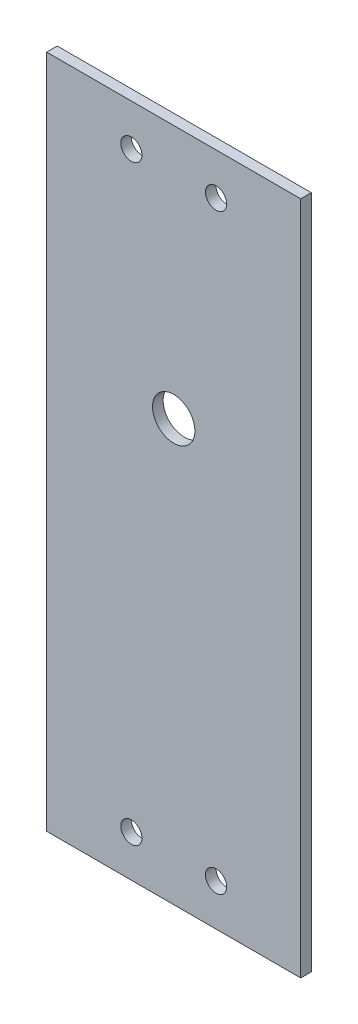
ISO-10303-21;
HEADER;
FILE_DESCRIPTION(('STEP AP214'),'2;1');
FILE_NAME('part.step','',(''),(''),'','','');
FILE_SCHEMA(('AUTOMOTIVE_DESIGN { 1 0 10303 214 1 1 1 1 }'));
ENDSEC;
DATA;
#1=APPLICATION_CONTEXT('core data for automotive mechanical design processes');
#2=APPLICATION_PROTOCOL_DEFINITION('international standard','automotive_design',2000,#1);
#3=PRODUCT_CONTEXT('',#1,'mechanical');
#4=PRODUCT('Part','Part','',(#3));
#5=PRODUCT_RELATED_PRODUCT_CATEGORY('part','',(#4));
#6=PRODUCT_DEFINITION_FORMATION('','',#4);
#7=PRODUCT_DEFINITION_CONTEXT('part definition',#1,'design');
#8=PRODUCT_DEFINITION('design','',#6,#7);
#9=PRODUCT_DEFINITION_SHAPE('','',#8);
#10=(LENGTH_UNIT() NAMED_UNIT(*) SI_UNIT(.MILLI.,.METRE.));
#11=(NAMED_UNIT(*) PLANE_ANGLE_UNIT() SI_UNIT($,.RADIAN.));
#12=(NAMED_UNIT(*) SI_UNIT($,.STERADIAN.) SOLID_ANGLE_UNIT());
#13=UNCERTAINTY_MEASURE_WITH_UNIT(LENGTH_MEASURE(1.E-05),#10,'distance_accuracy_value','');
#14=(GEOMETRIC_REPRESENTATION_CONTEXT(3) GLOBAL_UNCERTAINTY_ASSIGNED_CONTEXT((#13)) GLOBAL_UNIT_ASSIGNED_CONTEXT((#10,
#11,#12)) REPRESENTATION_CONTEXT('',''));
#15=CARTESIAN_POINT('',(0.,0.,0.));
#16=DIRECTION('',(0.,0.,1.));
#17=DIRECTION('',(1.,0.,0.));
#18=AXIS2_PLACEMENT_3D('',#15,#16,#17);
#19=CARTESIAN_POINT('',(76.2,0.,3.175));
#20=DIRECTION('',(0.,-1.,0.));
#21=DIRECTION('',(1.,0.,0.));
#22=AXIS2_PLACEMENT_3D('',#19,#20,#21);
#23=PLANE('',#22);
#24=DIRECTION('',(-1.,0.,0.));
#25=VECTOR('',#24,1.);
#26=CARTESIAN_POINT('',(76.2,0.,0.));
#27=LINE('',#26,#25);
#28=CARTESIAN_POINT('',(76.2,0.,0.));
#29=VERTEX_POINT('',#28);
#30=CARTESIAN_POINT('',(0.,0.,0.));
#31=VERTEX_POINT('',#30);
#32=EDGE_CURVE('E117',#29,#31,#27,.T.);
#33=ORIENTED_EDGE('',*,*,#32,.T.);
#34=DIRECTION('',(0.,0.,-1.));
#35=VECTOR('',#34,1.);
#36=CARTESIAN_POINT('',(0.,0.,3.175));
#37=LINE('',#36,#35);
#38=CARTESIAN_POINT('',(0.,0.,3.175));
#39=VERTEX_POINT('',#38);
#40=EDGE_CURVE('E12',#39,#31,#37,.T.);
#41=ORIENTED_EDGE('',*,*,#40,.F.);
#42=DIRECTION('',(-1.,0.,0.));
#43=VECTOR('',#42,1.);
#44=CARTESIAN_POINT('',(76.2,0.,3.175));
#45=LINE('',#44,#43);
#46=CARTESIAN_POINT('',(76.2,0.,3.175));
#47=VERTEX_POINT('',#46);
#48=EDGE_CURVE('E101',#47,#39,#45,.T.);
#49=ORIENTED_EDGE('',*,*,#48,.F.);
#50=DIRECTION('',(0.,0.,-1.));
#51=VECTOR('',#50,1.);
#52=CARTESIAN_POINT('',(76.2,0.,3.175));
#53=LINE('',#52,#51);
#54=EDGE_CURVE('E111',#47,#29,#53,.T.);
#55=ORIENTED_EDGE('',*,*,#54,.T.);
#56=EDGE_LOOP('',(#33,#41,#49,#55));
#57=FACE_BOUND('',#56,.T.);
#58=ADVANCED_FACE('F50',(#57),#23,.F.);
#59=CARTESIAN_POINT('',(0.,0.,3.175));
#60=DIRECTION('',(1.,0.,0.));
#61=DIRECTION('',(0.,1.,0.));
#62=AXIS2_PLACEMENT_3D('',#59,#60,#61);
#63=PLANE('',#62);
#64=DIRECTION('',(0.,-1.,0.));
#65=VECTOR('',#64,1.);
#66=CARTESIAN_POINT('',(0.,0.,0.));
#67=LINE('',#66,#65);
#68=CARTESIAN_POINT('',(0.,-202.4,0.));
#69=VERTEX_POINT('',#68);
#70=EDGE_CURVE('E106',#31,#69,#67,.T.);
#71=ORIENTED_EDGE('',*,*,#70,.T.);
#72=DIRECTION('',(0.,0.,-1.));
#73=VECTOR('',#72,1.);
#74=CARTESIAN_POINT('',(0.,-202.4,3.175));
#75=LINE('',#74,#73);
#76=CARTESIAN_POINT('',(0.,-202.4,3.175));
#77=VERTEX_POINT('',#76);
#78=EDGE_CURVE('E58',#77,#69,#75,.T.);
#79=ORIENTED_EDGE('',*,*,#78,.F.);
#80=DIRECTION('',(0.,-1.,0.));
#81=VECTOR('',#80,1.);
#82=CARTESIAN_POINT('',(0.,0.,3.175));
#83=LINE('',#82,#81);
#84=EDGE_CURVE('E96',#39,#77,#83,.T.);
#85=ORIENTED_EDGE('',*,*,#84,.F.);
#86=ORIENTED_EDGE('',*,*,#40,.T.);
#87=EDGE_LOOP('',(#71,#79,#85,#86));
#88=FACE_BOUND('',#87,.T.);
#89=ADVANCED_FACE('F105',(#88),#63,.F.);
#90=CARTESIAN_POINT('',(0.,-202.4,3.175));
#91=DIRECTION('',(0.,1.,0.));
#92=DIRECTION('',(0.,0.,1.));
#93=AXIS2_PLACEMENT_3D('',#90,#91,#92);
#94=PLANE('',#93);
#95=DIRECTION('',(1.,0.,0.));
#96=VECTOR('',#95,1.);
#97=CARTESIAN_POINT('',(0.,-202.4,0.));
#98=LINE('',#97,#96);
#99=CARTESIAN_POINT('',(76.2,-202.4,0.));
#100=VERTEX_POINT('',#99);
#101=EDGE_CURVE('E83',#69,#100,#98,.T.);
#102=ORIENTED_EDGE('',*,*,#101,.T.);
#103=DIRECTION('',(0.,0.,-1.));
#104=VECTOR('',#103,1.);
#105=CARTESIAN_POINT('',(76.2,-202.4,3.175));
#106=LINE('',#105,#104);
#107=CARTESIAN_POINT('',(76.2,-202.4,3.175));
#108=VERTEX_POINT('',#107);
#109=EDGE_CURVE('E107',#108,#100,#106,.T.);
#110=ORIENTED_EDGE('',*,*,#109,.F.);
#111=DIRECTION('',(1.,0.,0.));
#112=VECTOR('',#111,1.);
#113=CARTESIAN_POINT('',(0.,-202.4,3.175));
#114=LINE('',#113,#112);
#115=EDGE_CURVE('E99',#77,#108,#114,.T.);
#116=ORIENTED_EDGE('',*,*,#115,.F.);
#117=ORIENTED_EDGE('',*,*,#78,.T.);
#118=EDGE_LOOP('',(#102,#110,#116,#117));
#119=FACE_BOUND('',#118,.T.);
#120=ADVANCED_FACE('F108',(#119),#94,.F.);
#121=CARTESIAN_POINT('',(76.2,-202.4,3.175));
#122=DIRECTION('',(-1.,0.,0.));
#123=DIRECTION('',(0.,0.,1.));
#124=AXIS2_PLACEMENT_3D('',#121,#122,#123);
#125=PLANE('',#124);
#126=DIRECTION('',(0.,1.,0.));
#127=VECTOR('',#126,1.);
#128=CARTESIAN_POINT('',(76.2,-202.4,0.));
#129=LINE('',#128,#127);
#130=EDGE_CURVE('E89',#100,#29,#129,.T.);
#131=ORIENTED_EDGE('',*,*,#130,.T.);
#132=ORIENTED_EDGE('',*,*,#54,.F.);
#133=DIRECTION('',(0.,1.,0.));
#134=VECTOR('',#133,1.);
#135=CARTESIAN_POINT('',(76.2,-202.4,3.175));
#136=LINE('',#135,#134);
#137=EDGE_CURVE('E66',#108,#47,#136,.T.);
#138=ORIENTED_EDGE('',*,*,#137,.F.);
#139=ORIENTED_EDGE('',*,*,#109,.T.);
#140=EDGE_LOOP('',(#131,#132,#138,#139));
#141=FACE_BOUND('',#140,.T.);
#142=ADVANCED_FACE('F256',(#141),#125,.F.);
#143=CARTESIAN_POINT('',(0.,0.,3.175));
#144=DIRECTION('',(0.,0.,1.));
#145=DIRECTION('',(1.,0.,0.));
#146=AXIS2_PLACEMENT_3D('',#143,#144,#145);
#147=PLANE('',#146);
#148=CARTESIAN_POINT('',(38.1,-76.2,3.175));
#149=DIRECTION('',(0.,0.,1.));
#150=DIRECTION('',(1.,0.,0.));
#151=AXIS2_PLACEMENT_3D('',#148,#149,#150);
#152=CIRCLE('',#151,6.35);
#153=CARTESIAN_POINT('',(44.45,-76.2,3.175));
#154=VERTEX_POINT('',#153);
#155=EDGE_CURVE('E207',#154,#154,#152,.T.);
#156=ORIENTED_EDGE('',*,*,#155,.F.);
#157=EDGE_LOOP('',(#156));
#158=FACE_BOUND('',#157,.T.);
#159=CARTESIAN_POINT('',(25.4,-189.9,3.175));
#160=DIRECTION('',(0.,0.,1.));
#161=DIRECTION('',(-1.,0.,0.));
#162=AXIS2_PLACEMENT_3D('',#159,#160,#161);
#163=CIRCLE('',#162,3.175);
#164=CARTESIAN_POINT('',(22.225,-189.9,3.175));
#165=VERTEX_POINT('',#164);
#166=EDGE_CURVE('E140',#165,#165,#163,.T.);
#167=ORIENTED_EDGE('',*,*,#166,.F.);
#168=EDGE_LOOP('',(#167));
#169=FACE_BOUND('',#168,.T.);
#170=CARTESIAN_POINT('',(50.8,-189.9,3.175));
#171=DIRECTION('',(0.,0.,1.));
#172=DIRECTION('',(-1.,0.,0.));
#173=AXIS2_PLACEMENT_3D('',#170,#171,#172);
#174=CIRCLE('',#173,3.175);
#175=CARTESIAN_POINT('',(47.625,-189.9,3.175));
#176=VERTEX_POINT('',#175);
#177=EDGE_CURVE('E160',#176,#176,#174,.T.);
#178=ORIENTED_EDGE('',*,*,#177,.F.);
#179=EDGE_LOOP('',(#178));
#180=FACE_BOUND('',#179,.T.);
#181=CARTESIAN_POINT('',(50.8,-12.5,3.175));
#182=DIRECTION('',(0.,0.,1.));
#183=DIRECTION('',(1.,0.,0.));
#184=AXIS2_PLACEMENT_3D('',#181,#182,#183);
#185=CIRCLE('',#184,3.175);
#186=CARTESIAN_POINT('',(53.975,-12.5,3.175));
#187=VERTEX_POINT('',#186);
#188=EDGE_CURVE('E206',#187,#187,#185,.T.);
#189=ORIENTED_EDGE('',*,*,#188,.F.);
#190=EDGE_LOOP('',(#189));
#191=FACE_BOUND('',#190,.T.);
#192=CARTESIAN_POINT('',(25.4,-12.5,3.175));
#193=DIRECTION('',(0.,0.,1.));
#194=DIRECTION('',(1.,0.,0.));
#195=AXIS2_PLACEMENT_3D('',#192,#193,#194);
#196=CIRCLE('',#195,3.175);
#197=CARTESIAN_POINT('',(28.575,-12.5,3.175));
#198=VERTEX_POINT('',#197);
#199=EDGE_CURVE('E202',#198,#198,#196,.T.);
#200=ORIENTED_EDGE('',*,*,#199,.F.);
#201=EDGE_LOOP('',(#200));
#202=FACE_BOUND('',#201,.T.);
#203=ORIENTED_EDGE('',*,*,#48,.T.);
#204=ORIENTED_EDGE('',*,*,#84,.T.);
#205=ORIENTED_EDGE('',*,*,#115,.T.);
#206=ORIENTED_EDGE('',*,*,#137,.T.);
#207=EDGE_LOOP('',(#203,#204,#205,#206));
#208=FACE_BOUND('',#207,.T.);
#209=ADVANCED_FACE('F97',(#158,#169,#180,#191,#202,#208),#147,.T.);
#210=CARTESIAN_POINT('',(0.,0.,0.));
#211=DIRECTION('',(0.,0.,1.));
#212=DIRECTION('',(1.,0.,0.));
#213=AXIS2_PLACEMENT_3D('',#210,#211,#212);
#214=PLANE('',#213);
#215=CARTESIAN_POINT('',(38.1,-76.2,0.));
#216=DIRECTION('',(0.,0.,1.));
#217=DIRECTION('',(1.,0.,0.));
#218=AXIS2_PLACEMENT_3D('',#215,#216,#217);
#219=CIRCLE('',#218,6.35);
#220=CARTESIAN_POINT('',(44.45,-76.2,0.));
#221=VERTEX_POINT('',#220);
#222=EDGE_CURVE('E149',#221,#221,#219,.F.);
#223=ORIENTED_EDGE('',*,*,#222,.F.);
#224=EDGE_LOOP('',(#223));
#225=FACE_BOUND('',#224,.T.);
#226=CARTESIAN_POINT('',(25.4,-189.9,0.));
#227=DIRECTION('',(0.,0.,1.));
#228=DIRECTION('',(1.,0.,0.));
#229=AXIS2_PLACEMENT_3D('',#226,#227,#228);
#230=CIRCLE('',#229,3.175);
#231=CARTESIAN_POINT('',(28.575,-189.9,0.));
#232=VERTEX_POINT('',#231);
#233=EDGE_CURVE('E147',#232,#232,#230,.F.);
#234=ORIENTED_EDGE('',*,*,#233,.F.);
#235=EDGE_LOOP('',(#234));
#236=FACE_BOUND('',#235,.T.);
#237=CARTESIAN_POINT('',(50.8,-189.9,0.));
#238=DIRECTION('',(0.,0.,1.));
#239=DIRECTION('',(1.,0.,0.));
#240=AXIS2_PLACEMENT_3D('',#237,#238,#239);
#241=CIRCLE('',#240,3.175);
#242=CARTESIAN_POINT('',(53.975,-189.9,0.));
#243=VERTEX_POINT('',#242);
#244=EDGE_CURVE('E146',#243,#243,#241,.F.);
#245=ORIENTED_EDGE('',*,*,#244,.F.);
#246=EDGE_LOOP('',(#245));
#247=FACE_BOUND('',#246,.T.);
#248=CARTESIAN_POINT('',(50.8,-12.5,0.));
#249=DIRECTION('',(0.,0.,1.));
#250=DIRECTION('',(1.,0.,0.));
#251=AXIS2_PLACEMENT_3D('',#248,#249,#250);
#252=CIRCLE('',#251,3.175);
#253=CARTESIAN_POINT('',(53.975,-12.5,0.));
#254=VERTEX_POINT('',#253);
#255=EDGE_CURVE('E165',#254,#254,#252,.F.);
#256=ORIENTED_EDGE('',*,*,#255,.F.);
#257=EDGE_LOOP('',(#256));
#258=FACE_BOUND('',#257,.T.);
#259=CARTESIAN_POINT('',(25.4,-12.5,0.));
#260=DIRECTION('',(0.,0.,1.));
#261=DIRECTION('',(1.,0.,0.));
#262=AXIS2_PLACEMENT_3D('',#259,#260,#261);
#263=CIRCLE('',#262,3.175);
#264=CARTESIAN_POINT('',(28.575,-12.5,0.));
#265=VERTEX_POINT('',#264);
#266=EDGE_CURVE('E191',#265,#265,#263,.F.);
#267=ORIENTED_EDGE('',*,*,#266,.F.);
#268=EDGE_LOOP('',(#267));
#269=FACE_BOUND('',#268,.T.);
#270=ORIENTED_EDGE('',*,*,#32,.F.);
#271=ORIENTED_EDGE('',*,*,#130,.F.);
#272=ORIENTED_EDGE('',*,*,#101,.F.);
#273=ORIENTED_EDGE('',*,*,#70,.F.);
#274=EDGE_LOOP('',(#270,#271,#272,#273));
#275=FACE_BOUND('',#274,.T.);
#276=ADVANCED_FACE('F234',(#225,#236,#247,#258,#269,#275),#214,.F.);
#277=CARTESIAN_POINT('',(25.4,-12.5,-17.9605122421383));
#278=DIRECTION('',(0.,0.,1.));
#279=DIRECTION('',(1.,0.,0.));
#280=AXIS2_PLACEMENT_3D('',#277,#278,#279);
#281=CYLINDRICAL_SURFACE('',#280,3.175);
#282=ORIENTED_EDGE('',*,*,#266,.T.);
#283=EDGE_LOOP('',(#282));
#284=FACE_BOUND('',#283,.T.);
#285=ORIENTED_EDGE('',*,*,#199,.T.);
#286=EDGE_LOOP('',(#285));
#287=FACE_BOUND('',#286,.T.);
#288=ADVANCED_FACE('F237',(#284,#287),#281,.F.);
#289=CARTESIAN_POINT('',(50.8,-12.5,-17.9605122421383));
#290=DIRECTION('',(0.,0.,1.));
#291=DIRECTION('',(1.,0.,0.));
#292=AXIS2_PLACEMENT_3D('',#289,#290,#291);
#293=CYLINDRICAL_SURFACE('',#292,3.175);
#294=ORIENTED_EDGE('',*,*,#255,.T.);
#295=EDGE_LOOP('',(#294));
#296=FACE_BOUND('',#295,.T.);
#297=ORIENTED_EDGE('',*,*,#188,.T.);
#298=EDGE_LOOP('',(#297));
#299=FACE_BOUND('',#298,.T.);
#300=ADVANCED_FACE('F231',(#296,#299),#293,.F.);
#301=CARTESIAN_POINT('',(50.8,-189.9,-17.9605122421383));
#302=DIRECTION('',(0.,0.,1.));
#303=DIRECTION('',(1.,0.,0.));
#304=AXIS2_PLACEMENT_3D('',#301,#302,#303);
#305=CYLINDRICAL_SURFACE('',#304,3.175);
#306=ORIENTED_EDGE('',*,*,#244,.T.);
#307=EDGE_LOOP('',(#306));
#308=FACE_BOUND('',#307,.T.);
#309=ORIENTED_EDGE('',*,*,#177,.T.);
#310=EDGE_LOOP('',(#309));
#311=FACE_BOUND('',#310,.T.);
#312=ADVANCED_FACE('F294',(#308,#311),#305,.F.);
#313=CARTESIAN_POINT('',(25.4,-189.9,-17.9605122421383));
#314=DIRECTION('',(0.,0.,1.));
#315=DIRECTION('',(1.,0.,0.));
#316=AXIS2_PLACEMENT_3D('',#313,#314,#315);
#317=CYLINDRICAL_SURFACE('',#316,3.175);
#318=ORIENTED_EDGE('',*,*,#233,.T.);
#319=EDGE_LOOP('',(#318));
#320=FACE_BOUND('',#319,.T.);
#321=ORIENTED_EDGE('',*,*,#166,.T.);
#322=EDGE_LOOP('',(#321));
#323=FACE_BOUND('',#322,.T.);
#324=ADVANCED_FACE('F301',(#320,#323),#317,.F.);
#325=CARTESIAN_POINT('',(38.1,-76.2,-17.9605122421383));
#326=DIRECTION('',(0.,0.,1.));
#327=DIRECTION('',(1.,0.,0.));
#328=AXIS2_PLACEMENT_3D('',#325,#326,#327);
#329=CYLINDRICAL_SURFACE('',#328,6.35);
#330=ORIENTED_EDGE('',*,*,#222,.T.);
#331=EDGE_LOOP('',(#330));
#332=FACE_BOUND('',#331,.T.);
#333=ORIENTED_EDGE('',*,*,#155,.T.);
#334=EDGE_LOOP('',(#333));
#335=FACE_BOUND('',#334,.T.);
#336=ADVANCED_FACE('F309',(#332,#335),#329,.F.);
#337=CLOSED_SHELL('',(#58,#89,#120,#142,#209,#276,#288,#300,#312,#324,#336));
#338=MANIFOLD_SOLID_BREP('B2',#337);
#339=ADVANCED_BREP_SHAPE_REPRESENTATION('',(#18,#338),#14);
#340=SHAPE_DEFINITION_REPRESENTATION(#9,#339);
ENDSEC;
END-ISO-10303-21;
